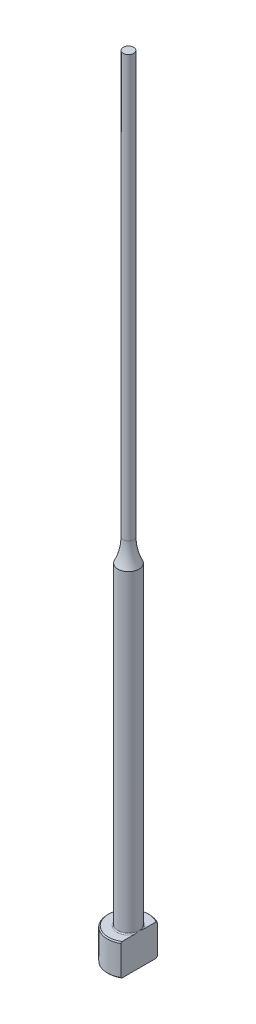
ISO-10303-21;
HEADER;
FILE_DESCRIPTION(('STEP AP214'),'2;1');
FILE_NAME('part.step','',(''),(''),'','','');
FILE_SCHEMA(('AUTOMOTIVE_DESIGN { 1 0 10303 214 1 1 1 1 }'));
ENDSEC;
DATA;
#1=APPLICATION_CONTEXT('core data for automotive mechanical design processes');
#2=APPLICATION_PROTOCOL_DEFINITION('international standard','automotive_design',2000,#1);
#3=PRODUCT_CONTEXT('',#1,'mechanical');
#4=PRODUCT('Part','Part','',(#3));
#5=PRODUCT_RELATED_PRODUCT_CATEGORY('part','',(#4));
#6=PRODUCT_DEFINITION_FORMATION('','',#4);
#7=PRODUCT_DEFINITION_CONTEXT('part definition',#1,'design');
#8=PRODUCT_DEFINITION('design','',#6,#7);
#9=PRODUCT_DEFINITION_SHAPE('','',#8);
#10=(LENGTH_UNIT() NAMED_UNIT(*) SI_UNIT(.MILLI.,.METRE.));
#11=(NAMED_UNIT(*) PLANE_ANGLE_UNIT() SI_UNIT($,.RADIAN.));
#12=(NAMED_UNIT(*) SI_UNIT($,.STERADIAN.) SOLID_ANGLE_UNIT());
#13=UNCERTAINTY_MEASURE_WITH_UNIT(LENGTH_MEASURE(1.E-05),#10,'distance_accuracy_value','');
#14=(GEOMETRIC_REPRESENTATION_CONTEXT(3) GLOBAL_UNCERTAINTY_ASSIGNED_CONTEXT((#13)) GLOBAL_UNIT_ASSIGNED_CONTEXT((#10,
#11,#12)) REPRESENTATION_CONTEXT('',''));
#15=CARTESIAN_POINT('',(0.,0.,0.));
#16=DIRECTION('',(0.,0.,1.));
#17=DIRECTION('',(1.,0.,0.));
#18=AXIS2_PLACEMENT_3D('',#15,#16,#17);
#19=CARTESIAN_POINT('',(-3.99999999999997,6.,0.));
#20=DIRECTION('',(0.,1.,0.));
#21=DIRECTION('',(0.,0.,1.));
#22=AXIS2_PLACEMENT_3D('',#19,#20,#21);
#23=PLANE('',#22);
#24=CARTESIAN_POINT('',(0.,6.,0.));
#25=DIRECTION('',(0.,1.,0.));
#26=DIRECTION('',(0.,0.,1.));
#27=AXIS2_PLACEMENT_3D('',#24,#25,#26);
#28=CIRCLE('',#27,3.79999999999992);
#29=CARTESIAN_POINT('',(1.99999999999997,6.,-3.23109888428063));
#30=VERTEX_POINT('',#29);
#31=CARTESIAN_POINT('',(1.99999999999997,6.,3.23109888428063));
#32=VERTEX_POINT('',#31);
#33=EDGE_CURVE('E187',#30,#32,#28,.T.);
#34=ORIENTED_EDGE('',*,*,#33,.T.);
#35=DIRECTION('',(0.,0.,-1.));
#36=VECTOR('',#35,1.);
#37=CARTESIAN_POINT('',(1.99999999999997,6.,0.));
#38=LINE('',#37,#36);
#39=CARTESIAN_POINT('',(1.99999999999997,5.99999999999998,0.916515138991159));
#40=VERTEX_POINT('',#39);
#41=EDGE_CURVE('E57',#32,#40,#38,.T.);
#42=ORIENTED_EDGE('',*,*,#41,.T.);
#43=CARTESIAN_POINT('',(0.,6.,0.));
#44=DIRECTION('',(0.,1.,0.));
#45=DIRECTION('',(0.,0.,1.));
#46=AXIS2_PLACEMENT_3D('',#43,#44,#45);
#47=CIRCLE('',#46,2.19999999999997);
#48=CARTESIAN_POINT('',(1.99999999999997,5.99999999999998,-0.916515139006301));
#49=VERTEX_POINT('',#48);
#50=EDGE_CURVE('E108',#40,#49,#47,.F.);
#51=ORIENTED_EDGE('',*,*,#50,.T.);
#52=EDGE_CURVE('E137',#49,#30,#38,.T.);
#53=ORIENTED_EDGE('',*,*,#52,.T.);
#54=EDGE_LOOP('',(#34,#42,#51,#53));
#55=FACE_BOUND('',#54,.T.);
#56=ADVANCED_FACE('F32',(#55),#23,.T.);
#57=CARTESIAN_POINT('',(0.,259.958771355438,0.));
#58=DIRECTION('',(0.,1.,0.));
#59=DIRECTION('',(0.,0.,1.));
#60=AXIS2_PLACEMENT_3D('',#57,#58,#59);
#61=CYLINDRICAL_SURFACE('',#60,3.99999999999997);
#62=CARTESIAN_POINT('',(0.,5.79999999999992,0.));
#63=DIRECTION('',(0.,1.,0.));
#64=DIRECTION('',(0.,0.,1.));
#65=AXIS2_PLACEMENT_3D('',#62,#63,#64);
#66=CIRCLE('',#65,3.99999999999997);
#67=CARTESIAN_POINT('',(1.99999999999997,5.79999999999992,3.46410161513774));
#68=VERTEX_POINT('',#67);
#69=CARTESIAN_POINT('',(1.99999999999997,5.79999999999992,-3.46410161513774));
#70=VERTEX_POINT('',#69);
#71=EDGE_CURVE('E105',#68,#70,#66,.F.);
#72=ORIENTED_EDGE('',*,*,#71,.T.);
#73=DIRECTION('',(0.,-1.,0.));
#74=VECTOR('',#73,1.);
#75=CARTESIAN_POINT('',(1.99999999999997,150.,-3.46410161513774));
#76=LINE('',#75,#74);
#77=CARTESIAN_POINT('',(1.99999999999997,0.199999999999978,-3.46410161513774));
#78=VERTEX_POINT('',#77);
#79=EDGE_CURVE('E193',#70,#78,#76,.T.);
#80=ORIENTED_EDGE('',*,*,#79,.T.);
#81=CARTESIAN_POINT('',(0.,0.199999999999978,0.));
#82=DIRECTION('',(0.,-1.,0.));
#83=DIRECTION('',(0.,0.,-1.));
#84=AXIS2_PLACEMENT_3D('',#81,#82,#83);
#85=CIRCLE('',#84,3.99999999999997);
#86=CARTESIAN_POINT('',(1.99999999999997,0.199999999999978,3.46410161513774));
#87=VERTEX_POINT('',#86);
#88=EDGE_CURVE('E100',#78,#87,#85,.F.);
#89=ORIENTED_EDGE('',*,*,#88,.T.);
#90=DIRECTION('',(0.,-1.,0.));
#91=VECTOR('',#90,1.);
#92=CARTESIAN_POINT('',(1.99999999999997,150.,3.46410161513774));
#93=LINE('',#92,#91);
#94=EDGE_CURVE('E93',#68,#87,#93,.T.);
#95=ORIENTED_EDGE('',*,*,#94,.F.);
#96=EDGE_LOOP('',(#72,#80,#89,#95));
#97=FACE_BOUND('',#96,.T.);
#98=ADVANCED_FACE('F158',(#97),#61,.T.);
#99=CARTESIAN_POINT('',(0.,0.,0.));
#100=DIRECTION('',(0.,-1.,0.));
#101=DIRECTION('',(0.,0.,-1.));
#102=AXIS2_PLACEMENT_3D('',#99,#100,#101);
#103=PLANE('',#102);
#104=CARTESIAN_POINT('',(0.,0.,0.));
#105=DIRECTION('',(0.,-1.,0.));
#106=DIRECTION('',(0.,0.,-1.));
#107=AXIS2_PLACEMENT_3D('',#104,#105,#106);
#108=CIRCLE('',#107,3.79999999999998);
#109=CARTESIAN_POINT('',(1.99999999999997,0.,3.2310988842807));
#110=VERTEX_POINT('',#109);
#111=CARTESIAN_POINT('',(1.99999999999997,0.,-3.2310988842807));
#112=VERTEX_POINT('',#111);
#113=EDGE_CURVE('E98',#110,#112,#108,.T.);
#114=ORIENTED_EDGE('',*,*,#113,.T.);
#115=DIRECTION('',(0.,0.,1.));
#116=VECTOR('',#115,1.);
#117=CARTESIAN_POINT('',(1.99999999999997,0.,3.46410161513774));
#118=LINE('',#117,#116);
#119=EDGE_CURVE('E83',#112,#110,#118,.T.);
#120=ORIENTED_EDGE('',*,*,#119,.T.);
#121=EDGE_LOOP('',(#114,#120));
#122=FACE_BOUND('',#121,.T.);
#123=ADVANCED_FACE('F103',(#122),#103,.T.);
#124=CARTESIAN_POINT('',(0.,6.00000000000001,0.));
#125=DIRECTION('',(0.,-1.,0.));
#126=DIRECTION('',(0.,0.,-1.));
#127=AXIS2_PLACEMENT_3D('',#124,#125,#126);
#128=CONICAL_SURFACE('',#127,3.79999999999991,0.785398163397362);
#129=ORIENTED_EDGE('',*,*,#71,.F.);
#130=CARTESIAN_POINT('',(1.99999999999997,1.91904532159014,7.62295524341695));
#131=CARTESIAN_POINT('',(1.99999999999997,2.08611243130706,7.4502239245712));
#132=CARTESIAN_POINT('',(1.99999999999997,2.25300024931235,7.27731861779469));
#133=CARTESIAN_POINT('',(1.99999999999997,2.58631125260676,6.93105655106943));
#134=CARTESIAN_POINT('',(1.99999999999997,2.75273443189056,6.75769978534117));
#135=CARTESIAN_POINT('',(1.99999999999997,3.08509080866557,6.41034692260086));
#136=CARTESIAN_POINT('',(1.99999999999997,3.25102371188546,6.23635054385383));
#137=CARTESIAN_POINT('',(1.99999999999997,3.5821559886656,5.88766284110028));
#138=CARTESIAN_POINT('',(1.99999999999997,3.74735536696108,5.71297152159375));
#139=CARTESIAN_POINT('',(1.99999999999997,4.07353855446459,5.36616839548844));
#140=CARTESIAN_POINT('',(1.99999999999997,4.23454099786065,5.19407412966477));
#141=CARTESIAN_POINT('',(1.99999999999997,4.55534102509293,4.84876663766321));
#142=CARTESIAN_POINT('',(1.99999999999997,4.71513861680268,4.67555341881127));
#143=CARTESIAN_POINT('',(1.99999999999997,5.03306183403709,4.32766569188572));
#144=CARTESIAN_POINT('',(1.99999999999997,5.1911878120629,4.15299150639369));
#145=CARTESIAN_POINT('',(1.99999999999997,5.50513944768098,3.80159134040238));
#146=CARTESIAN_POINT('',(1.99999999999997,5.66096519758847,3.62486544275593));
#147=CARTESIAN_POINT('',(1.99999999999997,5.90974646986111,3.33722425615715));
#148=CARTESIAN_POINT('',(1.99999999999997,6.00376148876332,3.22722645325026));
#149=CARTESIAN_POINT('',(1.99999999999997,6.19011825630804,3.00579987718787));
#150=CARTESIAN_POINT('',(1.99999999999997,6.28245983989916,2.89437096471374));
#151=CARTESIAN_POINT('',(1.99999999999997,6.46586188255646,2.66849662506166));
#152=CARTESIAN_POINT('',(1.99999999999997,6.55689849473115,2.5540317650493));
#153=CARTESIAN_POINT('',(1.99999999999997,6.73578809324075,2.32266819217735));
#154=CARTESIAN_POINT('',(1.99999999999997,6.82364184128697,2.20577007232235));
#155=CARTESIAN_POINT('',(1.99999999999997,6.99612756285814,1.96688707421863));
#156=CARTESIAN_POINT('',(1.99999999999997,7.08069035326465,1.84485190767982));
#157=CARTESIAN_POINT('',(1.99999999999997,7.2430026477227,1.59599329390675));
#158=CARTESIAN_POINT('',(1.99999999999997,7.32074277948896,1.46916359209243));
#159=CARTESIAN_POINT('',(1.99999999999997,7.42869763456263,1.27510066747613));
#160=CARTESIAN_POINT('',(1.99999999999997,7.46305374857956,1.21018943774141));
#161=CARTESIAN_POINT('',(1.99999999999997,7.52837146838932,1.07868835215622));
#162=CARTESIAN_POINT('',(1.99999999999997,7.5593324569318,1.01209819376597));
#163=CARTESIAN_POINT('',(1.99999999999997,7.64566860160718,0.809894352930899));
#164=CARTESIAN_POINT('',(1.99999999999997,7.69478214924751,0.671360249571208));
#165=CARTESIAN_POINT('',(1.99999999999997,7.7479482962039,0.463657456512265));
#166=CARTESIAN_POINT('',(1.99999999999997,7.76205065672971,0.397033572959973));
#167=CARTESIAN_POINT('',(1.99999999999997,7.78390371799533,0.262728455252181));
#168=CARTESIAN_POINT('',(1.99999999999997,7.79165498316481,0.19504731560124));
#169=CARTESIAN_POINT('',(1.99999999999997,7.80025690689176,0.0594528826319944));
#170=CARTESIAN_POINT('',(1.99999999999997,7.80112894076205,-0.00845903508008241));
#171=CARTESIAN_POINT('',(1.99999999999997,7.79596585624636,-0.144020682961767));
#172=CARTESIAN_POINT('',(1.99999999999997,7.78993016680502,-0.211670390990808));
#173=CARTESIAN_POINT('',(1.99999999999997,7.77145363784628,-0.345483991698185));
#174=CARTESIAN_POINT('',(1.99999999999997,7.75906777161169,-0.411655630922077));
#175=CARTESIAN_POINT('',(1.99999999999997,7.72866360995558,-0.542678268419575));
#176=CARTESIAN_POINT('',(1.99999999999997,7.71064463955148,-0.607529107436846));
#177=CARTESIAN_POINT('',(1.99999999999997,7.66972939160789,-0.736064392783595));
#178=CARTESIAN_POINT('',(1.99999999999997,7.64680564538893,-0.799739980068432));
#179=CARTESIAN_POINT('',(1.99999999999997,7.5970014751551,-0.925489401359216));
#180=CARTESIAN_POINT('',(1.99999999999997,7.57012185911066,-0.987563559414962));
#181=CARTESIAN_POINT('',(1.99999999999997,7.48443518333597,-1.17209020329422));
#182=CARTESIAN_POINT('',(1.99999999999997,7.42077407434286,-1.29228210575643));
#183=CARTESIAN_POINT('',(1.99999999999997,7.28502644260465,-1.52785770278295));
#184=CARTESIAN_POINT('',(1.99999999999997,7.21292931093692,-1.6432350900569));
#185=CARTESIAN_POINT('',(1.99999999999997,7.06281517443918,-1.8706938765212));
#186=CARTESIAN_POINT('',(1.99999999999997,6.98477595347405,-1.98276048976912));
#187=CARTESIAN_POINT('',(1.99999999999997,6.82481971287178,-2.20397837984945));
#188=CARTESIAN_POINT('',(1.99999999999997,6.74290465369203,-2.31313108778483));
#189=CARTESIAN_POINT('',(1.99999999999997,6.5751722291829,-2.5306854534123));
#190=CARTESIAN_POINT('',(1.99999999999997,6.48931769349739,-2.63905831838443));
#191=CARTESIAN_POINT('',(1.99999999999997,6.31548151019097,-2.85409686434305));
#192=CARTESIAN_POINT('',(1.99999999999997,6.22749963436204,-2.96076236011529));
#193=CARTESIAN_POINT('',(1.99999999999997,6.0501503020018,-3.17249211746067));
#194=CARTESIAN_POINT('',(1.99999999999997,5.96078672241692,-3.27755963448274));
#195=CARTESIAN_POINT('',(1.99999999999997,5.78082366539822,-3.48663191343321));
#196=CARTESIAN_POINT('',(1.99999999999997,5.69022416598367,-3.59063665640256));
#197=CARTESIAN_POINT('',(1.99999999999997,5.44796733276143,-3.86612439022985));
#198=CARTESIAN_POINT('',(1.99999999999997,5.29545972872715,-4.03685912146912));
#199=CARTESIAN_POINT('',(1.99999999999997,4.98858070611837,-4.37664803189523));
#200=CARTESIAN_POINT('',(1.99999999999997,4.834209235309,-4.54570216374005));
#201=CARTESIAN_POINT('',(1.99999999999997,4.52396102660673,-4.88271638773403));
#202=CARTESIAN_POINT('',(1.99999999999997,4.36808300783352,-5.05067529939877));
#203=CARTESIAN_POINT('',(1.99999999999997,4.05530513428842,-5.38563883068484));
#204=CARTESIAN_POINT('',(1.99999999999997,3.89840527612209,-5.55264344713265));
#205=CARTESIAN_POINT('',(1.99999999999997,3.59029018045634,-5.87905385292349));
#206=CARTESIAN_POINT('',(1.99999999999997,3.43910664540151,-6.03848959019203));
#207=CARTESIAN_POINT('',(1.99999999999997,3.13616436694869,-6.35681456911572));
#208=CARTESIAN_POINT('',(1.99999999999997,2.98440562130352,-6.5157038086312));
#209=CARTESIAN_POINT('',(1.99999999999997,2.68059501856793,-6.83286192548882));
#210=CARTESIAN_POINT('',(1.99999999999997,2.5285436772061,-6.99113129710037));
#211=CARTESIAN_POINT('',(1.99999999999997,2.22406035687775,-7.30730102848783));
#212=CARTESIAN_POINT('',(1.99999999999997,2.07162838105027,-7.46520139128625));
#213=CARTESIAN_POINT('',(1.99999999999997,1.91904532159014,-7.62295524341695));
#214=B_SPLINE_CURVE_WITH_KNOTS('',3,(#130,#131,#132,#133,#134,#135,#136,#137,#138,#139,#140,
#141,#142,#143,#144,#145,#146,#147,#148,#149,#150,#151,#152,#153,#154,#155,#156,#157,#158,#159,
#160,#161,#162,#163,#164,#165,#166,#167,#168,#169,#170,#171,#172,#173,#174,#175,#176,#177,#178,
#179,#180,#181,#182,#183,#184,#185,#186,#187,#188,#189,#190,#191,#192,#193,#194,#195,#196,#197,
#198,#199,#200,#201,#202,#203,#204,#205,#206,#207,#208,#209,#210,#211,#212,#213),.UNSPECIFIED.,
.F.,.F.,(4,2,2,2,2,2,2,2,2,2,2,2,2,2,2,2,2,2,2,2,2,2,2,2,2,2,2,2,2,2,2,2,2,2,2,2,2,2,2,2,2,4),
(0.,0.720921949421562,1.4418531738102,2.16315326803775,2.8844486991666,3.59144103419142,
4.29842874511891,5.00526427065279,5.7120713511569,6.14616174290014,6.58029471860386,
7.01901494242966,7.45762947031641,7.90290456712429,8.34878206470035,8.56901415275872,
8.78928621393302,9.228144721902,9.43219512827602,9.63622739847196,9.83962544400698,
10.0430403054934,10.244723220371,10.4464303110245,10.6492980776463,10.8521244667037,
11.2595582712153,11.6675100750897,12.0770700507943,12.4864250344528,12.9011677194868,
13.3159550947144,13.7297367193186,14.1435257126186,14.8302935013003,15.5170805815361,
16.2045145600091,16.891950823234,17.5511045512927,18.2102608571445,18.8686819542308,
19.5270976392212),.UNSPECIFIED.);
#215=EDGE_CURVE('E136',#68,#32,#214,.T.);
#216=ORIENTED_EDGE('',*,*,#215,.T.);
#217=ORIENTED_EDGE('',*,*,#33,.F.);
#218=EDGE_CURVE('E128',#30,#70,#214,.T.);
#219=ORIENTED_EDGE('',*,*,#218,.T.);
#220=EDGE_LOOP('',(#129,#216,#217,#219));
#221=FACE_BOUND('',#220,.T.);
#222=ADVANCED_FACE('F144',(#221),#128,.T.);
#223=CARTESIAN_POINT('',(0.,0.199999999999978,0.));
#224=DIRECTION('',(0.,1.,0.));
#225=DIRECTION('',(0.,0.,1.));
#226=AXIS2_PLACEMENT_3D('',#223,#224,#225);
#227=CONICAL_SURFACE('',#226,3.99999999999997,0.785398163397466);
#228=ORIENTED_EDGE('',*,*,#88,.F.);
#229=CARTESIAN_POINT('',(1.99999999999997,4.08095467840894,-7.62295524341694));
#230=CARTESIAN_POINT('',(1.99999999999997,3.91388756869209,-7.45022392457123));
#231=CARTESIAN_POINT('',(1.99999999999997,3.74699975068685,-7.27731861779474));
#232=CARTESIAN_POINT('',(1.99999999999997,3.41368874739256,-6.93105655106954));
#233=CARTESIAN_POINT('',(1.99999999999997,3.24726556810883,-6.7576997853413));
#234=CARTESIAN_POINT('',(1.99999999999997,2.91490919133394,-6.41034692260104));
#235=CARTESIAN_POINT('',(1.99999999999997,2.7489762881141,-6.23635054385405));
#236=CARTESIAN_POINT('',(1.99999999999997,2.41784401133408,-5.88766284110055));
#237=CARTESIAN_POINT('',(1.99999999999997,2.25264463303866,-5.71297152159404));
#238=CARTESIAN_POINT('',(1.99999999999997,1.92646144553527,-5.36616839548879));
#239=CARTESIAN_POINT('',(1.99999999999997,1.76545900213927,-5.19407412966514));
#240=CARTESIAN_POINT('',(1.99999999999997,1.44465897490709,-4.84876663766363));
#241=CARTESIAN_POINT('',(1.99999999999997,1.28486138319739,-4.67555341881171));
#242=CARTESIAN_POINT('',(1.99999999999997,0.966938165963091,-4.32766569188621));
#243=CARTESIAN_POINT('',(1.99999999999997,0.808812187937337,-4.1529915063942));
#244=CARTESIAN_POINT('',(1.99999999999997,0.494860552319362,-3.80159134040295));
#245=CARTESIAN_POINT('',(1.99999999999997,0.339034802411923,-3.62486544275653));
#246=CARTESIAN_POINT('',(1.99999999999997,0.0902535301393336,-3.33722425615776));
#247=CARTESIAN_POINT('',(1.99999999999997,-0.0037614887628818,-3.22722645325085));
#248=CARTESIAN_POINT('',(1.99999999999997,-0.190118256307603,-3.00579987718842));
#249=CARTESIAN_POINT('',(1.99999999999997,-0.282459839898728,-2.89437096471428));
#250=CARTESIAN_POINT('',(1.99999999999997,-0.465861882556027,-2.66849662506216));
#251=CARTESIAN_POINT('',(1.99999999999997,-0.556898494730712,-2.55403176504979));
#252=CARTESIAN_POINT('',(1.99999999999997,-0.735788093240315,-2.3226681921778));
#253=CARTESIAN_POINT('',(1.99999999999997,-0.823641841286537,-2.20577007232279));
#254=CARTESIAN_POINT('',(1.99999999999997,-0.996127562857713,-1.96688707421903));
#255=CARTESIAN_POINT('',(1.99999999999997,-1.08069035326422,-1.84485190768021));
#256=CARTESIAN_POINT('',(1.99999999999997,-1.24300264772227,-1.59599329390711));
#257=CARTESIAN_POINT('',(1.99999999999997,-1.32074277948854,-1.46916359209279));
#258=CARTESIAN_POINT('',(1.99999999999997,-1.42869763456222,-1.27510066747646));
#259=CARTESIAN_POINT('',(1.99999999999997,-1.46305374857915,-1.21018943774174));
#260=CARTESIAN_POINT('',(1.99999999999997,-1.52837146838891,-1.07868835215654));
#261=CARTESIAN_POINT('',(1.99999999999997,-1.5593324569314,-1.01209819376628));
#262=CARTESIAN_POINT('',(1.99999999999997,-1.64566860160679,-0.809894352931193));
#263=CARTESIAN_POINT('',(1.99999999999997,-1.69478214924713,-0.671360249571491));
#264=CARTESIAN_POINT('',(1.99999999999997,-1.74794829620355,-0.46365745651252));
#265=CARTESIAN_POINT('',(1.99999999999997,-1.76205065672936,-0.39703357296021));
#266=CARTESIAN_POINT('',(1.99999999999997,-1.783903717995,-0.26272845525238));
#267=CARTESIAN_POINT('',(1.99999999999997,-1.79165498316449,-0.195047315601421));
#268=CARTESIAN_POINT('',(1.99999999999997,-1.80025690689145,-0.0594528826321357));
#269=CARTESIAN_POINT('',(1.99999999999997,-1.80112894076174,0.00845903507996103));
#270=CARTESIAN_POINT('',(1.99999999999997,-1.79596585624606,0.144020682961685));
#271=CARTESIAN_POINT('',(1.99999999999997,-1.78993016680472,0.211670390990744));
#272=CARTESIAN_POINT('',(1.99999999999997,-1.77145363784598,0.345483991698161));
#273=CARTESIAN_POINT('',(1.99999999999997,-1.75906777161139,0.411655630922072));
#274=CARTESIAN_POINT('',(1.99999999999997,-1.72866360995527,0.542678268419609));
#275=CARTESIAN_POINT('',(1.99999999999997,-1.71064463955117,0.607529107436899));
#276=CARTESIAN_POINT('',(1.99999999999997,-1.66972939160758,0.736064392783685));
#277=CARTESIAN_POINT('',(1.99999999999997,-1.64680564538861,0.799739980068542));
#278=CARTESIAN_POINT('',(1.99999999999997,-1.59700147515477,0.925489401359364));
#279=CARTESIAN_POINT('',(1.99999999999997,-1.57012185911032,0.987563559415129));
#280=CARTESIAN_POINT('',(1.99999999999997,-1.4844351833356,1.17209020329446));
#281=CARTESIAN_POINT('',(1.99999999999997,-1.42077407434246,1.29228210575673));
#282=CARTESIAN_POINT('',(1.99999999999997,-1.2850264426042,1.52785770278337));
#283=CARTESIAN_POINT('',(1.99999999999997,-1.21292931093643,1.64323509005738));
#284=CARTESIAN_POINT('',(1.99999999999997,-1.06281517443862,1.87069387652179));
#285=CARTESIAN_POINT('',(1.99999999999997,-0.984775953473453,1.98276048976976));
#286=CARTESIAN_POINT('',(1.99999999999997,-0.824819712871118,2.2039783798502));
#287=CARTESIAN_POINT('',(1.99999999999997,-0.742904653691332,2.31313108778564));
#288=CARTESIAN_POINT('',(1.99999999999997,-0.575172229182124,2.53068545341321));
#289=CARTESIAN_POINT('',(1.99999999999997,-0.489317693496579,2.6390583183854));
#290=CARTESIAN_POINT('',(1.99999999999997,-0.315481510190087,2.85409686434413));
#291=CARTESIAN_POINT('',(1.99999999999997,-0.227499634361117,2.96076236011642));
#292=CARTESIAN_POINT('',(1.99999999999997,-0.0501503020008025,3.17249211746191));
#293=CARTESIAN_POINT('',(1.99999999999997,0.039213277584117,3.27755963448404));
#294=CARTESIAN_POINT('',(1.99999999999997,0.219176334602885,3.48663191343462));
#295=CARTESIAN_POINT('',(1.99999999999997,0.309775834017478,3.59063665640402));
#296=CARTESIAN_POINT('',(1.99999999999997,0.552032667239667,3.86612439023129));
#297=CARTESIAN_POINT('',(1.99999999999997,0.704540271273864,4.03685912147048));
#298=CARTESIAN_POINT('',(1.99999999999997,1.01141929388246,4.37664803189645));
#299=CARTESIAN_POINT('',(1.99999999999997,1.16579076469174,4.54570216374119));
#300=CARTESIAN_POINT('',(1.99999999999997,1.47603897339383,4.88271638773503));
#301=CARTESIAN_POINT('',(1.99999999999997,1.63191699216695,5.0506752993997));
#302=CARTESIAN_POINT('',(1.99999999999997,1.94469486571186,5.38563883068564));
#303=CARTESIAN_POINT('',(1.99999999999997,2.10159472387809,5.55264344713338));
#304=CARTESIAN_POINT('',(1.99999999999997,2.40970981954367,5.87905385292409));
#305=CARTESIAN_POINT('',(1.99999999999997,2.56089335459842,6.03848959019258));
#306=CARTESIAN_POINT('',(1.99999999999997,2.86383563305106,6.35681456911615));
#307=CARTESIAN_POINT('',(1.99999999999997,3.01559437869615,6.51570380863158));
#308=CARTESIAN_POINT('',(1.99999999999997,3.31940498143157,6.83286192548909));
#309=CARTESIAN_POINT('',(1.99999999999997,3.47145632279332,6.99113129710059));
#310=CARTESIAN_POINT('',(1.99999999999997,3.77593964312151,7.30730102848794));
#311=CARTESIAN_POINT('',(1.99999999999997,3.9283716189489,7.4652013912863));
#312=CARTESIAN_POINT('',(1.99999999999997,4.08095467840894,7.62295524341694));
#313=B_SPLINE_CURVE_WITH_KNOTS('',3,(#229,#230,#231,#232,#233,#234,#235,#236,#237,#238,#239,
#240,#241,#242,#243,#244,#245,#246,#247,#248,#249,#250,#251,#252,#253,#254,#255,#256,#257,#258,
#259,#260,#261,#262,#263,#264,#265,#266,#267,#268,#269,#270,#271,#272,#273,#274,#275,#276,#277,
#278,#279,#280,#281,#282,#283,#284,#285,#286,#287,#288,#289,#290,#291,#292,#293,#294,#295,#296,
#297,#298,#299,#300,#301,#302,#303,#304,#305,#306,#307,#308,#309,#310,#311,#312),.UNSPECIFIED.,
.F.,.F.,(4,2,2,2,2,2,2,2,2,2,2,2,2,2,2,2,2,2,2,2,2,2,2,2,2,2,2,2,2,2,2,2,2,2,2,2,2,2,2,2,2,4),
(0.,0.720921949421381,1.44185317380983,2.1631532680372,2.88444869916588,3.59144103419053,
4.29842874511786,5.00526427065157,5.71207135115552,6.1461617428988,6.58029471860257,
7.0190149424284,7.4576294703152,7.90290456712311,8.34878206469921,8.56901415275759,
8.78928621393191,9.22814472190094,9.43219512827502,9.63622739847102,9.83962544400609,
10.0430403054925,10.2447232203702,10.4464303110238,10.6492980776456,10.8521244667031,
11.2595582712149,11.6675100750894,12.0770700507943,12.486425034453,12.9011677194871,
13.3159550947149,13.7297367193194,14.1435257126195,14.8302935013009,15.5170805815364,
16.2045145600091,16.8919508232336,17.551104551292,18.2102608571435,18.8686819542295,
19.5270976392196),.UNSPECIFIED.);
#314=EDGE_CURVE('E86',#78,#112,#313,.T.);
#315=ORIENTED_EDGE('',*,*,#314,.T.);
#316=ORIENTED_EDGE('',*,*,#113,.F.);
#317=EDGE_CURVE('E89',#110,#87,#313,.T.);
#318=ORIENTED_EDGE('',*,*,#317,.T.);
#319=EDGE_LOOP('',(#228,#315,#316,#318));
#320=FACE_BOUND('',#319,.T.);
#321=ADVANCED_FACE('F97',(#320),#227,.T.);
#322=CARTESIAN_POINT('',(0.,6.19999999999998,0.));
#323=DIRECTION('',(0.,1.,0.));
#324=DIRECTION('',(0.,0.,1.));
#325=AXIS2_PLACEMENT_3D('',#322,#323,#324);
#326=TOROIDAL_SURFACE('',#325,2.19999999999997,0.2);
#327=CARTESIAN_POINT('',(1.99999999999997,6.19999999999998,0.));
#328=CARTESIAN_POINT('',(1.99999999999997,6.20000050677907,1.13930141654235E-10));
#329=CARTESIAN_POINT('',(1.99999999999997,6.20000101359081,-1.46766795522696E-07));
#330=CARTESIAN_POINT('',(1.99999999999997,6.20000197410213,-5.82067451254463E-07));
#331=CARTESIAN_POINT('',(1.99999999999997,6.20000242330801,-8.77873018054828E-07));
#332=CARTESIAN_POINT('',(1.99999999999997,6.2000033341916,-1.5842451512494E-06));
#333=CARTESIAN_POINT('',(1.99999999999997,6.20000378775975,-2.00534283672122E-06));
#334=CARTESIAN_POINT('',(1.99999999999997,6.20000462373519,-2.89558841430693E-06));
#335=CARTESIAN_POINT('',(1.99999999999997,6.20000500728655,-3.36372325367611E-06));
#336=CARTESIAN_POINT('',(1.99999999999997,6.20000636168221,-5.10887550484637E-06));
#337=CARTESIAN_POINT('',(1.99999999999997,6.20000725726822,-6.44597279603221E-06));
#338=CARTESIAN_POINT('',(1.99999999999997,6.20000879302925,-9.14926716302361E-06));
#339=CARTESIAN_POINT('',(1.99999999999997,6.20000944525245,-1.0508971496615E-05));
#340=CARTESIAN_POINT('',(1.99999999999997,6.20001204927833,-1.60555880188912E-05));
#341=CARTESIAN_POINT('',(1.99999999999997,6.20001390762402,-2.02908747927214E-05));
#342=CARTESIAN_POINT('',(1.99999999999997,6.20001676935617,-2.84438494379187E-05));
#343=CARTESIAN_POINT('',(1.99999999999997,6.20001785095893,-3.23343259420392E-05));
#344=CARTESIAN_POINT('',(1.99999999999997,6.20002551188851,-6.06027145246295E-05));
#345=CARTESIAN_POINT('',(1.99999999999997,6.20003111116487,-8.51991847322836E-05));
#346=CARTESIAN_POINT('',(1.99999999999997,6.20005559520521,-0.00018156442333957));
#347=CARTESIAN_POINT('',(1.99999999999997,6.20007914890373,-0.000252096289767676));
#348=CARTESIAN_POINT('',(1.99999999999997,6.20017002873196,-0.00052958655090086));
#349=CARTESIAN_POINT('',(1.99999999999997,6.20023415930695,-0.00073729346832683));
#350=CARTESIAN_POINT('',(1.99999999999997,6.20048926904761,-0.00155657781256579));
#351=CARTESIAN_POINT('',(1.99999999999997,6.20068414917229,-0.00216722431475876));
#352=CARTESIAN_POINT('',(1.99999999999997,6.20148805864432,-0.0046938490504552));
#353=CARTESIAN_POINT('',(1.99999999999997,6.20209226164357,-0.00661098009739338));
#354=CARTESIAN_POINT('',(1.99999999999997,6.20822779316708,-0.026069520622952));
#355=CARTESIAN_POINT('',(1.99999999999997,6.21378174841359,-0.0436057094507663));
#356=CARTESIAN_POINT('',(1.99999999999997,6.22462834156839,-0.0780127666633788));
#357=CARTESIAN_POINT('',(1.99999999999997,6.22992277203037,-0.0948831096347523));
#358=CARTESIAN_POINT('',(1.99999999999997,6.24110477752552,-0.130713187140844));
#359=CARTESIAN_POINT('',(1.99999999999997,6.24698536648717,-0.149675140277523));
#360=CARTESIAN_POINT('',(1.99999999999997,6.25869835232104,-0.187834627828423));
#361=CARTESIAN_POINT('',(1.99999999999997,6.26452957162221,-0.207032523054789));
#362=CARTESIAN_POINT('',(1.99999999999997,6.27861584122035,-0.254071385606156));
#363=CARTESIAN_POINT('',(1.99999999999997,6.28678835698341,-0.281937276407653));
#364=CARTESIAN_POINT('',(1.99999999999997,6.30249503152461,-0.33711523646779));
#365=CARTESIAN_POINT('',(1.99999999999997,6.31003989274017,-0.364424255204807));
#366=CARTESIAN_POINT('',(1.99999999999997,6.32554795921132,-0.422841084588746));
#367=CARTESIAN_POINT('',(1.99999999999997,6.33343288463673,-0.453970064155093));
#368=CARTESIAN_POINT('',(1.99999999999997,6.34833120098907,-0.516667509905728));
#369=CARTESIAN_POINT('',(1.99999999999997,6.3553379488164,-0.548237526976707));
#370=CARTESIAN_POINT('',(1.99999999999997,6.37554978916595,-0.647984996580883));
#371=CARTESIAN_POINT('',(1.99999999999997,6.38665117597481,-0.716635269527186));
#372=CARTESIAN_POINT('',(1.99999999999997,6.39785773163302,-0.8324457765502));
#373=CARTESIAN_POINT('',(1.99999999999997,6.40036304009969,-0.879345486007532));
#374=CARTESIAN_POINT('',(1.99999999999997,6.39976024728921,-0.949238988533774));
#375=CARTESIAN_POINT('',(1.99999999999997,6.39886048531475,-0.97224857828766));
#376=CARTESIAN_POINT('',(1.99999999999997,6.39534463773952,-1.01812773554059));
#377=CARTESIAN_POINT('',(1.99999999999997,6.39273014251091,-1.04099741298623));
#378=CARTESIAN_POINT('',(1.99999999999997,6.38623968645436,-1.08102660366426));
#379=CARTESIAN_POINT('',(1.99999999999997,6.38280841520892,-1.09825717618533));
#380=CARTESIAN_POINT('',(1.99999999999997,6.37442567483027,-1.13243508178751));
#381=CARTESIAN_POINT('',(1.99999999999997,6.36946777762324,-1.14938089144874));
#382=CARTESIAN_POINT('',(1.99999999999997,6.35764172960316,-1.18276398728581));
#383=CARTESIAN_POINT('',(1.99999999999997,6.35075810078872,-1.1991959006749));
#384=CARTESIAN_POINT('',(1.99999999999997,6.33462082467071,-1.23083581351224));
#385=CARTESIAN_POINT('',(1.99999999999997,6.32537783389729,-1.24604892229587));
#386=CARTESIAN_POINT('',(1.99999999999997,6.30929159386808,-1.26715296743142));
#387=CARTESIAN_POINT('',(1.99999999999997,6.303567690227,-1.27389441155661));
#388=CARTESIAN_POINT('',(1.99999999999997,6.29128925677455,-1.28659894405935));
#389=CARTESIAN_POINT('',(1.99999999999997,6.28473413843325,-1.29256147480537));
#390=CARTESIAN_POINT('',(1.99999999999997,6.27066594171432,-1.30346436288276));
#391=CARTESIAN_POINT('',(1.99999999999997,6.26314132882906,-1.30839014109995));
#392=CARTESIAN_POINT('',(1.99999999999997,6.24727957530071,-1.31668687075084));
#393=CARTESIAN_POINT('',(1.99999999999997,6.23894498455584,-1.32006252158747));
#394=CARTESIAN_POINT('',(1.99999999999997,6.22424089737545,-1.3241557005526));
#395=CARTESIAN_POINT('',(1.99999999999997,6.21800630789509,-1.32536112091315));
#396=CARTESIAN_POINT('',(1.99999999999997,6.20542266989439,-1.32669615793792));
#397=CARTESIAN_POINT('',(1.99999999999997,6.19907368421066,-1.32682634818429));
#398=CARTESIAN_POINT('',(1.99999999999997,6.18645152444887,-1.32599950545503));
#399=CARTESIAN_POINT('',(1.99999999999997,6.18017831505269,-1.32504300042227));
#400=CARTESIAN_POINT('',(1.99999999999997,6.16787181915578,-1.32212308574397));
#401=CARTESIAN_POINT('',(1.99999999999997,6.16183869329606,-1.32015901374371));
#402=CARTESIAN_POINT('',(1.99999999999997,6.14844260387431,-1.31466566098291));
#403=CARTESIAN_POINT('',(1.99999999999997,6.14119825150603,-1.3108482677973));
#404=CARTESIAN_POINT('',(1.99999999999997,6.12742328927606,-1.30209252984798));
#405=CARTESIAN_POINT('',(1.99999999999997,6.12089414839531,-1.29715193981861));
#406=CARTESIAN_POINT('',(1.99999999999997,6.10554761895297,-1.28382084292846));
#407=CARTESIAN_POINT('',(1.99999999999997,6.09717242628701,-1.27492468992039));
#408=CARTESIAN_POINT('',(1.99999999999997,6.08188323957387,-1.25597903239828));
#409=CARTESIAN_POINT('',(1.99999999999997,6.07497120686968,-1.24592800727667));
#410=CARTESIAN_POINT('',(1.99999999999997,6.05771073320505,-1.21734573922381));
#411=CARTESIAN_POINT('',(1.99999999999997,6.04862251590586,-1.19806017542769));
#412=CARTESIAN_POINT('',(1.99999999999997,6.03323781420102,-1.15830155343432));
#413=CARTESIAN_POINT('',(1.99999999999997,6.02696471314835,-1.13782009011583));
#414=CARTESIAN_POINT('',(1.99999999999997,6.01659159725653,-1.09607450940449));
#415=CARTESIAN_POINT('',(1.99999999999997,6.01251776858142,-1.07480405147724));
#416=CARTESIAN_POINT('',(1.99999999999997,6.0061890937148,-1.03196822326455));
#417=CARTESIAN_POINT('',(1.99999999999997,6.00393768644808,-1.0104023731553));
#418=CARTESIAN_POINT('',(1.99999999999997,5.99950887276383,-0.946948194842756));
#419=CARTESIAN_POINT('',(1.99999999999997,5.99937097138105,-0.904921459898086));
#420=CARTESIAN_POINT('',(1.99999999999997,6.00391139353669,-0.800067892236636));
#421=CARTESIAN_POINT('',(1.99999999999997,6.01103947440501,-0.737378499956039));
#422=CARTESIAN_POINT('',(1.99999999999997,6.0310998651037,-0.61144432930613));
#423=CARTESIAN_POINT('',(1.99999999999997,6.04417074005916,-0.54822386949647));
#424=CARTESIAN_POINT('',(1.99999999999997,6.06920011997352,-0.442888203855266));
#425=CARTESIAN_POINT('',(1.99999999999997,6.08016343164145,-0.400527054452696));
#426=CARTESIAN_POINT('',(1.99999999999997,6.10315303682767,-0.316588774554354));
#427=CARTESIAN_POINT('',(1.99999999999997,6.11516655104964,-0.275008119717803));
#428=CARTESIAN_POINT('',(1.99999999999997,6.13853403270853,-0.196672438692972));
#429=CARTESIAN_POINT('',(1.99999999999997,6.14981294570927,-0.159894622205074));
#430=CARTESIAN_POINT('',(1.99999999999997,6.17316886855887,-0.0849211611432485));
#431=CARTESIAN_POINT('',(1.99999999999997,6.18525959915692,-0.046729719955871));
#432=CARTESIAN_POINT('',(1.99999999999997,6.1979086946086,-0.00660765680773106));
#433=CARTESIAN_POINT('',(1.99999999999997,6.19851400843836,-0.00468723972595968));
#434=CARTESIAN_POINT('',(1.99999999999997,6.199318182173,-0.00215985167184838));
#435=CARTESIAN_POINT('',(1.99999999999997,6.19951225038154,-0.0015517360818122));
#436=CARTESIAN_POINT('',(1.99999999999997,6.19976637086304,-0.000735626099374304));
#437=CARTESIAN_POINT('',(1.99999999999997,6.19983030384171,-0.000528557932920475));
#438=CARTESIAN_POINT('',(1.99999999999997,6.19992094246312,-0.00025181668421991));
#439=CARTESIAN_POINT('',(1.99999999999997,6.1999444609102,-0.000181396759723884));
#440=CARTESIAN_POINT('',(1.99999999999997,6.19996891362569,-8.51622338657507E-05));
#441=CARTESIAN_POINT('',(1.99999999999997,6.19997450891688,-6.05824645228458E-05));
#442=CARTESIAN_POINT('',(1.99999999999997,6.19998216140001,-3.23308902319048E-05));
#443=CARTESIAN_POINT('',(1.99999999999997,6.19998324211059,-2.8441435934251E-05));
#444=CARTESIAN_POINT('',(1.99999999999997,6.19998610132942,-2.02904710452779E-05));
#445=CARTESIAN_POINT('',(1.99999999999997,6.19998795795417,-1.6056119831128E-05));
#446=CARTESIAN_POINT('',(1.99999999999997,6.19999055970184,-1.05104411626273E-05));
#447=CARTESIAN_POINT('',(1.99999999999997,6.19999121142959,-9.15081317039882E-06));
#448=CARTESIAN_POINT('',(1.99999999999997,6.19999274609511,-6.44758195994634E-06));
#449=CARTESIAN_POINT('',(1.99999999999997,6.19999364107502,-5.11046373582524E-06));
#450=CARTESIAN_POINT('',(1.99999999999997,6.1999949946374,-3.36517635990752E-06));
#451=CARTESIAN_POINT('',(1.99999999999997,6.19999537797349,-2.8969795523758E-06));
#452=CARTESIAN_POINT('',(1.99999999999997,6.19999621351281,-2.00657125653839E-06));
#453=CARTESIAN_POINT('',(1.99999999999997,6.19999666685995,-1.58537196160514E-06));
#454=CARTESIAN_POINT('',(1.99999999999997,6.19999757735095,-8.78757217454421E-07));
#455=CARTESIAN_POINT('',(1.99999999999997,6.19999802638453,-5.82817893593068E-07));
#456=CARTESIAN_POINT('',(1.99999999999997,6.19999898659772,-1.47186735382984E-07));
#457=CARTESIAN_POINT('',(1.99999999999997,6.19999949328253,-1.13916285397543E-10));
#458=CARTESIAN_POINT('',(1.99999999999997,6.19999999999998,0.));
#459=B_SPLINE_CURVE_WITH_KNOTS('',3,(#327,#328,#329,#330,#331,#332,#333,#334,#335,#336,#337,
#338,#339,#340,#341,#342,#343,#344,#345,#346,#347,#348,#349,#350,#351,#352,#353,#354,#355,#356,
#357,#358,#359,#360,#361,#362,#363,#364,#365,#366,#367,#368,#369,#370,#371,#372,#373,#374,#375,
#376,#377,#378,#379,#380,#381,#382,#383,#384,#385,#386,#387,#388,#389,#390,#391,#392,#393,#394,
#395,#396,#397,#398,#399,#400,#401,#402,#403,#404,#405,#406,#407,#408,#409,#410,#411,#412,#413,
#414,#415,#416,#417,#418,#419,#420,#421,#422,#423,#424,#425,#426,#427,#428,#429,#430,#431,#432,
#433,#434,#435,#436,#437,#438,#439,#440,#441,#442,#443,#444,#445,#446,#447,#448,#449,#450,#451,
#452,#453,#454,#455,#456,#457,#458),.UNSPECIFIED.,.T.,.F.,(4,2,2,2,2,2,2,2,2,2,2,2,2,2,2,2,2,2,
2,2,2,2,2,2,2,2,2,2,2,2,2,2,2,2,2,2,2,2,2,2,2,2,2,2,2,2,2,2,2,2,2,2,2,2,2,2,2,2,2,2,2,2,2,2,2,
4),(0.,1.5236988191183E-06,3.13175174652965E-06,4.9793386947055E-06,6.79332712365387E-06,
1.16005918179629E-05,1.61211188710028E-05,2.99630983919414E-05,4.20611839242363E-05,
0.000117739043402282,0.000340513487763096,0.000992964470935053,0.00291555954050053,
0.00894623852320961,0.0641278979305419,0.117173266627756,0.176731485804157,0.23692308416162,
0.324038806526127,0.409031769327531,0.505353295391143,0.602364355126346,0.810598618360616,
0.951214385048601,1.02024793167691,1.08921754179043,1.14187257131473,1.19475241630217,
1.24807013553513,1.30115116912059,1.32762610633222,1.35411989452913,1.38096446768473,
1.40772711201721,1.42669285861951,1.44564848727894,1.46459491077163,1.48355380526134,
1.50798338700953,1.53246223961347,1.56891061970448,1.60540755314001,1.6690093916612,
1.73313017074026,1.79799846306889,1.86298887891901,1.9887768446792,2.17764082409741,
2.37115413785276,2.50240556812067,2.63223743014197,2.74764208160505,2.86781494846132,
2.87385601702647,2.8757706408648,2.87642108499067,2.87664350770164,2.87671913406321,
2.87673122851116,2.87674506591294,2.87674958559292,2.87675439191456,2.87675620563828,
2.87675805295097,2.87675966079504,2.87676118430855),.UNSPECIFIED.);
#460=CARTESIAN_POINT('',(1.99999999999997,6.19999999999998,0.));
#461=VERTEX_POINT('',#460);
#462=EDGE_CURVE('E11',#49,#461,#459,.T.);
#463=ORIENTED_EDGE('',*,*,#462,.F.);
#464=ORIENTED_EDGE('',*,*,#50,.F.);
#465=CARTESIAN_POINT('',(1.99999999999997,6.19999999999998,0.));
#466=CARTESIAN_POINT('',(1.99999999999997,6.19999949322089,-1.13930155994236E-10));
#467=CARTESIAN_POINT('',(1.99999999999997,6.19999898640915,1.46766795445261E-07));
#468=CARTESIAN_POINT('',(1.99999999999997,6.19999802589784,5.8206745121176E-07));
#469=CARTESIAN_POINT('',(1.99999999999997,6.19999757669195,8.77873018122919E-07));
#470=CARTESIAN_POINT('',(1.99999999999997,6.19999666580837,1.58424515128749E-06));
#471=CARTESIAN_POINT('',(1.99999999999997,6.19999621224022,2.00534283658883E-06));
#472=CARTESIAN_POINT('',(1.99999999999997,6.19999537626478,2.8955884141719E-06));
#473=CARTESIAN_POINT('',(1.99999999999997,6.19999499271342,3.36372325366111E-06));
#474=CARTESIAN_POINT('',(1.99999999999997,6.19999363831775,5.10887550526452E-06));
#475=CARTESIAN_POINT('',(1.99999999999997,6.19999274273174,6.44597279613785E-06));
#476=CARTESIAN_POINT('',(1.99999999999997,6.19999120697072,9.14926716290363E-06));
#477=CARTESIAN_POINT('',(1.99999999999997,6.19999055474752,1.05089714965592E-05));
#478=CARTESIAN_POINT('',(1.99999999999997,6.19998795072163,1.60555880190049E-05));
#479=CARTESIAN_POINT('',(1.99999999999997,6.19998609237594,2.02908747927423E-05));
#480=CARTESIAN_POINT('',(1.99999999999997,6.1999832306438,2.84438494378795E-05));
#481=CARTESIAN_POINT('',(1.99999999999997,6.19998214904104,3.23343259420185E-05));
#482=CARTESIAN_POINT('',(1.99999999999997,6.19997448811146,6.06027145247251E-05));
#483=CARTESIAN_POINT('',(1.99999999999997,6.1999688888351,8.51991847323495E-05));
#484=CARTESIAN_POINT('',(1.99999999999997,6.19994440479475,0.000181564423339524));
#485=CARTESIAN_POINT('',(1.99999999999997,6.19992085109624,0.000252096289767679));
#486=CARTESIAN_POINT('',(1.99999999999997,6.199829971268,0.000529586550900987));
#487=CARTESIAN_POINT('',(1.99999999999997,6.19976584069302,0.000737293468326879));
#488=CARTESIAN_POINT('',(1.99999999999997,6.19951073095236,0.00155657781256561));
#489=CARTESIAN_POINT('',(1.99999999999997,6.19931585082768,0.00216722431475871));
#490=CARTESIAN_POINT('',(1.99999999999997,6.19851194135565,0.00469384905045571));
#491=CARTESIAN_POINT('',(1.99999999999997,6.1979077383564,0.00661098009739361));
#492=CARTESIAN_POINT('',(1.99999999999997,6.19177220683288,0.0260695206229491));
#493=CARTESIAN_POINT('',(1.99999999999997,6.18621825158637,0.0436057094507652));
#494=CARTESIAN_POINT('',(1.99999999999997,6.17537165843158,0.078012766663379));
#495=CARTESIAN_POINT('',(1.99999999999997,6.1700772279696,0.0948831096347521));
#496=CARTESIAN_POINT('',(1.99999999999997,6.15889522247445,0.130713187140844));
#497=CARTESIAN_POINT('',(1.99999999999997,6.1530146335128,0.149675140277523));
#498=CARTESIAN_POINT('',(1.99999999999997,6.14130164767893,0.187834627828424));
#499=CARTESIAN_POINT('',(1.99999999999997,6.13547042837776,0.207032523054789));
#500=CARTESIAN_POINT('',(1.99999999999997,6.12138415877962,0.254071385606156));
#501=CARTESIAN_POINT('',(1.99999999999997,6.11321164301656,0.281937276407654));
#502=CARTESIAN_POINT('',(1.99999999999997,6.09750496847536,0.337115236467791));
#503=CARTESIAN_POINT('',(1.99999999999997,6.0899601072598,0.364424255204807));
#504=CARTESIAN_POINT('',(1.99999999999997,6.07445204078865,0.422841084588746));
#505=CARTESIAN_POINT('',(1.99999999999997,6.06656711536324,0.453970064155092));
#506=CARTESIAN_POINT('',(1.99999999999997,6.0516687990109,0.516667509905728));
#507=CARTESIAN_POINT('',(1.99999999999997,6.04466205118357,0.548237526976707));
#508=CARTESIAN_POINT('',(1.99999999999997,6.02445021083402,0.647984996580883));
#509=CARTESIAN_POINT('',(1.99999999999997,6.01334882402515,0.716635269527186));
#510=CARTESIAN_POINT('',(1.99999999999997,6.00214226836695,0.8324457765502));
#511=CARTESIAN_POINT('',(1.99999999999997,5.99963695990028,0.879345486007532));
#512=CARTESIAN_POINT('',(1.99999999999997,6.00023975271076,0.949238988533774));
#513=CARTESIAN_POINT('',(1.99999999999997,6.00113951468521,0.972248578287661));
#514=CARTESIAN_POINT('',(1.99999999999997,6.00465536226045,1.01812773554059));
#515=CARTESIAN_POINT('',(1.99999999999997,6.00726985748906,1.04099741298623));
#516=CARTESIAN_POINT('',(1.99999999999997,6.01376031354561,1.08102660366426));
#517=CARTESIAN_POINT('',(1.99999999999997,6.01719158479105,1.09825717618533));
#518=CARTESIAN_POINT('',(1.99999999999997,6.02557432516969,1.13243508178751));
#519=CARTESIAN_POINT('',(1.99999999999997,6.03053222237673,1.14938089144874));
#520=CARTESIAN_POINT('',(1.99999999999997,6.04235827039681,1.18276398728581));
#521=CARTESIAN_POINT('',(1.99999999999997,6.04924189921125,1.1991959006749));
#522=CARTESIAN_POINT('',(1.99999999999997,6.06537917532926,1.23083581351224));
#523=CARTESIAN_POINT('',(1.99999999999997,6.07462216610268,1.24604892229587));
#524=CARTESIAN_POINT('',(1.99999999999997,6.09070840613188,1.26715296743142));
#525=CARTESIAN_POINT('',(1.99999999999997,6.09643230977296,1.27389441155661));
#526=CARTESIAN_POINT('',(1.99999999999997,6.10871074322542,1.28659894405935));
#527=CARTESIAN_POINT('',(1.99999999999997,6.11526586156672,1.29256147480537));
#528=CARTESIAN_POINT('',(1.99999999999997,6.12933405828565,1.30346436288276));
#529=CARTESIAN_POINT('',(1.99999999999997,6.1368586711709,1.30839014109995));
#530=CARTESIAN_POINT('',(1.99999999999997,6.15272042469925,1.31668687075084));
#531=CARTESIAN_POINT('',(1.99999999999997,6.16105501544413,1.32006252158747));
#532=CARTESIAN_POINT('',(1.99999999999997,6.17575910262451,1.3241557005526));
#533=CARTESIAN_POINT('',(1.99999999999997,6.18199369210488,1.32536112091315));
#534=CARTESIAN_POINT('',(1.99999999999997,6.19457733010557,1.32669615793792));
#535=CARTESIAN_POINT('',(1.99999999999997,6.20092631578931,1.32682634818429));
#536=CARTESIAN_POINT('',(1.99999999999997,6.21354847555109,1.32599950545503));
#537=CARTESIAN_POINT('',(1.99999999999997,6.21982168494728,1.32504300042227));
#538=CARTESIAN_POINT('',(1.99999999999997,6.23212818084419,1.32212308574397));
#539=CARTESIAN_POINT('',(1.99999999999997,6.23816130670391,1.32015901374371));
#540=CARTESIAN_POINT('',(1.99999999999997,6.25155739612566,1.31466566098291));
#541=CARTESIAN_POINT('',(1.99999999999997,6.25880174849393,1.3108482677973));
#542=CARTESIAN_POINT('',(1.99999999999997,6.2725767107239,1.30209252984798));
#543=CARTESIAN_POINT('',(1.99999999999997,6.27910585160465,1.29715193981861));
#544=CARTESIAN_POINT('',(1.99999999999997,6.29445238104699,1.28382084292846));
#545=CARTESIAN_POINT('',(1.99999999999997,6.30282757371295,1.27492468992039));
#546=CARTESIAN_POINT('',(1.99999999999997,6.3181167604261,1.25597903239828));
#547=CARTESIAN_POINT('',(1.99999999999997,6.32502879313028,1.24592800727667));
#548=CARTESIAN_POINT('',(1.99999999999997,6.34228926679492,1.21734573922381));
#549=CARTESIAN_POINT('',(1.99999999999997,6.35137748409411,1.19806017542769));
#550=CARTESIAN_POINT('',(1.99999999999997,6.36676218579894,1.15830155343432));
#551=CARTESIAN_POINT('',(1.99999999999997,6.37303528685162,1.13782009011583));
#552=CARTESIAN_POINT('',(1.99999999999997,6.38340840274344,1.09607450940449));
#553=CARTESIAN_POINT('',(1.99999999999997,6.38748223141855,1.07480405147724));
#554=CARTESIAN_POINT('',(1.99999999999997,6.39381090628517,1.03196822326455));
#555=CARTESIAN_POINT('',(1.99999999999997,6.39606231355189,1.0104023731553));
#556=CARTESIAN_POINT('',(1.99999999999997,6.40049112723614,0.946948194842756));
#557=CARTESIAN_POINT('',(1.99999999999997,6.40062902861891,0.904921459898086));
#558=CARTESIAN_POINT('',(1.99999999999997,6.39608860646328,0.800067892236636));
#559=CARTESIAN_POINT('',(1.99999999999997,6.38896052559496,0.73737849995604));
#560=CARTESIAN_POINT('',(1.99999999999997,6.36890013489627,0.611444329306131));
#561=CARTESIAN_POINT('',(1.99999999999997,6.35582925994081,0.548223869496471));
#562=CARTESIAN_POINT('',(1.99999999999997,6.33079988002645,0.442888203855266));
#563=CARTESIAN_POINT('',(1.99999999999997,6.31983656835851,0.400527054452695));
#564=CARTESIAN_POINT('',(1.99999999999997,6.29684696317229,0.316588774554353));
#565=CARTESIAN_POINT('',(1.99999999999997,6.28483344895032,0.275008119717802));
#566=CARTESIAN_POINT('',(1.99999999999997,6.26146596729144,0.196672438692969));
#567=CARTESIAN_POINT('',(1.99999999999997,6.2501870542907,0.15989462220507));
#568=CARTESIAN_POINT('',(1.99999999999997,6.22683113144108,0.0849211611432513));
#569=CARTESIAN_POINT('',(1.99999999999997,6.214740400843,0.0467297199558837));
#570=CARTESIAN_POINT('',(1.99999999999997,6.20209130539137,0.00660765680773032));
#571=CARTESIAN_POINT('',(1.99999999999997,6.20148599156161,0.00468723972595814));
#572=CARTESIAN_POINT('',(1.99999999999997,6.20068181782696,0.00215985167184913));
#573=CARTESIAN_POINT('',(1.99999999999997,6.20048774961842,0.00155173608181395));
#574=CARTESIAN_POINT('',(1.99999999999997,6.20023362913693,0.000735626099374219));
#575=CARTESIAN_POINT('',(1.99999999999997,6.20016969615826,0.000528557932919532));
#576=CARTESIAN_POINT('',(1.99999999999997,6.20007905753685,0.000251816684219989));
#577=CARTESIAN_POINT('',(1.99999999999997,6.20005553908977,0.000181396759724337));
#578=CARTESIAN_POINT('',(1.99999999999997,6.20003108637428,8.51622338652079E-05));
#579=CARTESIAN_POINT('',(1.99999999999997,6.20002549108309,6.05824645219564E-05));
#580=CARTESIAN_POINT('',(1.99999999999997,6.20001783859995,3.2330890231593E-05));
#581=CARTESIAN_POINT('',(1.99999999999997,6.20001675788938,2.84414359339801E-05));
#582=CARTESIAN_POINT('',(1.99999999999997,6.20001389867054,2.02904710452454E-05));
#583=CARTESIAN_POINT('',(1.99999999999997,6.20001204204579,1.6056119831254E-05));
#584=CARTESIAN_POINT('',(1.99999999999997,6.20000944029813,1.05104411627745E-05));
#585=CARTESIAN_POINT('',(1.99999999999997,6.20000878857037,9.15081317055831E-06));
#586=CARTESIAN_POINT('',(1.99999999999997,6.20000725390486,6.44758195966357E-06));
#587=CARTESIAN_POINT('',(1.99999999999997,6.20000635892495,5.11046373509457E-06));
#588=CARTESIAN_POINT('',(1.99999999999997,6.20000500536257,3.36517636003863E-06));
#589=CARTESIAN_POINT('',(1.99999999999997,6.20000462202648,2.89697955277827E-06));
#590=CARTESIAN_POINT('',(1.99999999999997,6.20000378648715,2.00657125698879E-06));
#591=CARTESIAN_POINT('',(1.99999999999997,6.20000333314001,1.58537196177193E-06));
#592=CARTESIAN_POINT('',(1.99999999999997,6.20000242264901,8.78757217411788E-07));
#593=CARTESIAN_POINT('',(1.99999999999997,6.20000197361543,5.82817893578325E-07));
#594=CARTESIAN_POINT('',(1.99999999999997,6.20000101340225,1.47186735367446E-07));
#595=CARTESIAN_POINT('',(1.99999999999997,6.20000050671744,1.13916299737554E-10));
#596=CARTESIAN_POINT('',(1.99999999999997,6.19999999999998,0.));
#597=B_SPLINE_CURVE_WITH_KNOTS('',3,(#465,#466,#467,#468,#469,#470,#471,#472,#473,#474,#475,
#476,#477,#478,#479,#480,#481,#482,#483,#484,#485,#486,#487,#488,#489,#490,#491,#492,#493,#494,
#495,#496,#497,#498,#499,#500,#501,#502,#503,#504,#505,#506,#507,#508,#509,#510,#511,#512,#513,
#514,#515,#516,#517,#518,#519,#520,#521,#522,#523,#524,#525,#526,#527,#528,#529,#530,#531,#532,
#533,#534,#535,#536,#537,#538,#539,#540,#541,#542,#543,#544,#545,#546,#547,#548,#549,#550,#551,
#552,#553,#554,#555,#556,#557,#558,#559,#560,#561,#562,#563,#564,#565,#566,#567,#568,#569,#570,
#571,#572,#573,#574,#575,#576,#577,#578,#579,#580,#581,#582,#583,#584,#585,#586,#587,#588,#589,
#590,#591,#592,#593,#594,#595,#596),.UNSPECIFIED.,.T.,.F.,(4,2,2,2,2,2,2,2,2,2,2,2,2,2,2,2,2,2,
2,2,2,2,2,2,2,2,2,2,2,2,2,2,2,2,2,2,2,2,2,2,2,2,2,2,2,2,2,2,2,2,2,2,2,2,2,2,2,2,2,2,2,2,2,2,2,
4),(0.,1.5236988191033E-06,3.13175174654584E-06,4.97933869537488E-06,6.79332712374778E-06,
1.16005918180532E-05,1.61211188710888E-05,2.99630983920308E-05,4.20611839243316E-05,
0.000117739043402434,0.000340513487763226,0.000992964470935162,0.00291555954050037,
0.00894623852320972,0.0641278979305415,0.117173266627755,0.176731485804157,0.236923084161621,
0.324038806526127,0.409031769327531,0.505353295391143,0.602364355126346,0.810598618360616,
0.951214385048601,1.02024793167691,1.08921754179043,1.14187257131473,1.19475241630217,
1.24807013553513,1.30115116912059,1.32762610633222,1.35411989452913,1.38096446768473,
1.40772711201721,1.42669285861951,1.44564848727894,1.46459491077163,1.48355380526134,
1.50798338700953,1.53246223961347,1.56891061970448,1.60540755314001,1.6690093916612,
1.73313017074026,1.79799846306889,1.86298887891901,1.9887768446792,2.17764082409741,
2.37115413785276,2.50240556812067,2.63223743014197,2.74764208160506,2.86781494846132,
2.87385601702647,2.8757706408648,2.87642108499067,2.87664350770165,2.87671913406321,
2.87673122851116,2.87674506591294,2.87674958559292,2.87675439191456,2.87675620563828,
2.87675805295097,2.87675966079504,2.87676118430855),.UNSPECIFIED.);
#598=EDGE_CURVE('E46',#461,#40,#597,.T.);
#599=ORIENTED_EDGE('',*,*,#598,.F.);
#600=CARTESIAN_POINT('',(0.,6.19999999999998,0.));
#601=DIRECTION('',(0.,1.,0.));
#602=DIRECTION('',(0.,0.,1.));
#603=AXIS2_PLACEMENT_3D('',#600,#601,#602);
#604=CIRCLE('',#603,1.99999999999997);
#605=EDGE_CURVE('E104',#461,#461,#604,.T.);
#606=ORIENTED_EDGE('',*,*,#605,.F.);
#607=EDGE_LOOP('',(#463,#464,#599,#606));
#608=FACE_BOUND('',#607,.T.);
#609=ADVANCED_FACE('F34',(#608),#326,.F.);
#610=CARTESIAN_POINT('',(-0.999999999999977,150.,0.));
#611=DIRECTION('',(0.,1.,0.));
#612=DIRECTION('',(0.,0.,1.));
#613=AXIS2_PLACEMENT_3D('',#610,#611,#612);
#614=PLANE('',#613);
#615=CARTESIAN_POINT('',(0.,150.,0.));
#616=DIRECTION('',(0.,1.,0.));
#617=DIRECTION('',(0.,0.,1.));
#618=AXIS2_PLACEMENT_3D('',#615,#616,#617);
#619=CIRCLE('',#618,0.999999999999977);
#620=CARTESIAN_POINT('',(0.,150.,0.999999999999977));
#621=VERTEX_POINT('',#620);
#622=EDGE_CURVE('E186',#621,#621,#619,.T.);
#623=ORIENTED_EDGE('',*,*,#622,.T.);
#624=EDGE_LOOP('',(#623));
#625=FACE_BOUND('',#624,.T.);
#626=ADVANCED_FACE('F149',(#625),#614,.T.);
#627=CARTESIAN_POINT('',(0.,259.958771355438,0.));
#628=DIRECTION('',(0.,1.,0.));
#629=DIRECTION('',(0.,0.,1.));
#630=AXIS2_PLACEMENT_3D('',#627,#628,#629);
#631=CYLINDRICAL_SURFACE('',#630,0.999999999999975);
#632=CARTESIAN_POINT('',(0.,70.,0.));
#633=DIRECTION('',(0.,1.,0.));
#634=DIRECTION('',(0.,0.,1.));
#635=AXIS2_PLACEMENT_3D('',#632,#633,#634);
#636=CIRCLE('',#635,0.999999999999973);
#637=CARTESIAN_POINT('',(0.,70.,0.999999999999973));
#638=VERTEX_POINT('',#637);
#639=EDGE_CURVE('E183',#638,#638,#636,.T.);
#640=ORIENTED_EDGE('',*,*,#639,.T.);
#641=EDGE_LOOP('',(#640));
#642=FACE_BOUND('',#641,.T.);
#643=ORIENTED_EDGE('',*,*,#622,.F.);
#644=EDGE_LOOP('',(#643));
#645=FACE_BOUND('',#644,.T.);
#646=ADVANCED_FACE('F172',(#642,#645),#631,.T.);
#647=CARTESIAN_POINT('',(0.,70.,0.));
#648=DIRECTION('',(0.,1.,0.));
#649=DIRECTION('',(0.,0.,1.));
#650=AXIS2_PLACEMENT_3D('',#647,#648,#649);
#651=TOROIDAL_SURFACE('',#650,11.,10.);
#652=CARTESIAN_POINT('',(0.,65.6411010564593,0.));
#653=DIRECTION('',(0.,1.,0.));
#654=DIRECTION('',(0.,0.,1.));
#655=AXIS2_PLACEMENT_3D('',#652,#653,#654);
#656=CIRCLE('',#655,1.99999999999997);
#657=CARTESIAN_POINT('',(0.,65.6411010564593,1.99999999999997));
#658=VERTEX_POINT('',#657);
#659=EDGE_CURVE('E101',#658,#658,#656,.T.);
#660=ORIENTED_EDGE('',*,*,#659,.T.);
#661=EDGE_LOOP('',(#660));
#662=FACE_BOUND('',#661,.T.);
#663=ORIENTED_EDGE('',*,*,#639,.F.);
#664=EDGE_LOOP('',(#663));
#665=FACE_BOUND('',#664,.T.);
#666=ADVANCED_FACE('F169',(#662,#665),#651,.F.);
#667=CARTESIAN_POINT('',(0.,259.958771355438,0.));
#668=DIRECTION('',(0.,1.,0.));
#669=DIRECTION('',(0.,0.,1.));
#670=AXIS2_PLACEMENT_3D('',#667,#668,#669);
#671=CYLINDRICAL_SURFACE('',#670,1.99999999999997);
#672=ORIENTED_EDGE('',*,*,#605,.T.);
#673=EDGE_LOOP('',(#672));
#674=FACE_BOUND('',#673,.T.);
#675=ORIENTED_EDGE('',*,*,#659,.F.);
#676=EDGE_LOOP('',(#675));
#677=FACE_BOUND('',#676,.T.);
#678=ADVANCED_FACE('F122',(#674,#677),#671,.T.);
#679=CARTESIAN_POINT('',(1.99999999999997,150.,3.46410161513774));
#680=DIRECTION('',(1.,0.,0.));
#681=DIRECTION('',(0.,0.,-1.));
#682=AXIS2_PLACEMENT_3D('',#679,#680,#681);
#683=PLANE('',#682);
#684=ORIENTED_EDGE('',*,*,#79,.F.);
#685=ORIENTED_EDGE('',*,*,#218,.F.);
#686=ORIENTED_EDGE('',*,*,#52,.F.);
#687=ORIENTED_EDGE('',*,*,#462,.T.);
#688=ORIENTED_EDGE('',*,*,#598,.T.);
#689=ORIENTED_EDGE('',*,*,#41,.F.);
#690=ORIENTED_EDGE('',*,*,#215,.F.);
#691=ORIENTED_EDGE('',*,*,#94,.T.);
#692=ORIENTED_EDGE('',*,*,#317,.F.);
#693=ORIENTED_EDGE('',*,*,#119,.F.);
#694=ORIENTED_EDGE('',*,*,#314,.F.);
#695=EDGE_LOOP('',(#684,#685,#686,#687,#688,#689,#690,#691,#692,#693,#694));
#696=FACE_BOUND('',#695,.T.);
#697=ADVANCED_FACE('F85',(#696),#683,.T.);
#698=CLOSED_SHELL('',(#56,#98,#123,#222,#321,#609,#626,#646,#666,#678,#697));
#699=MANIFOLD_SOLID_BREP('B2',#698);
#700=ADVANCED_BREP_SHAPE_REPRESENTATION('',(#18,#699),#14);
#701=SHAPE_DEFINITION_REPRESENTATION(#9,#700);
ENDSEC;
END-ISO-10303-21;
